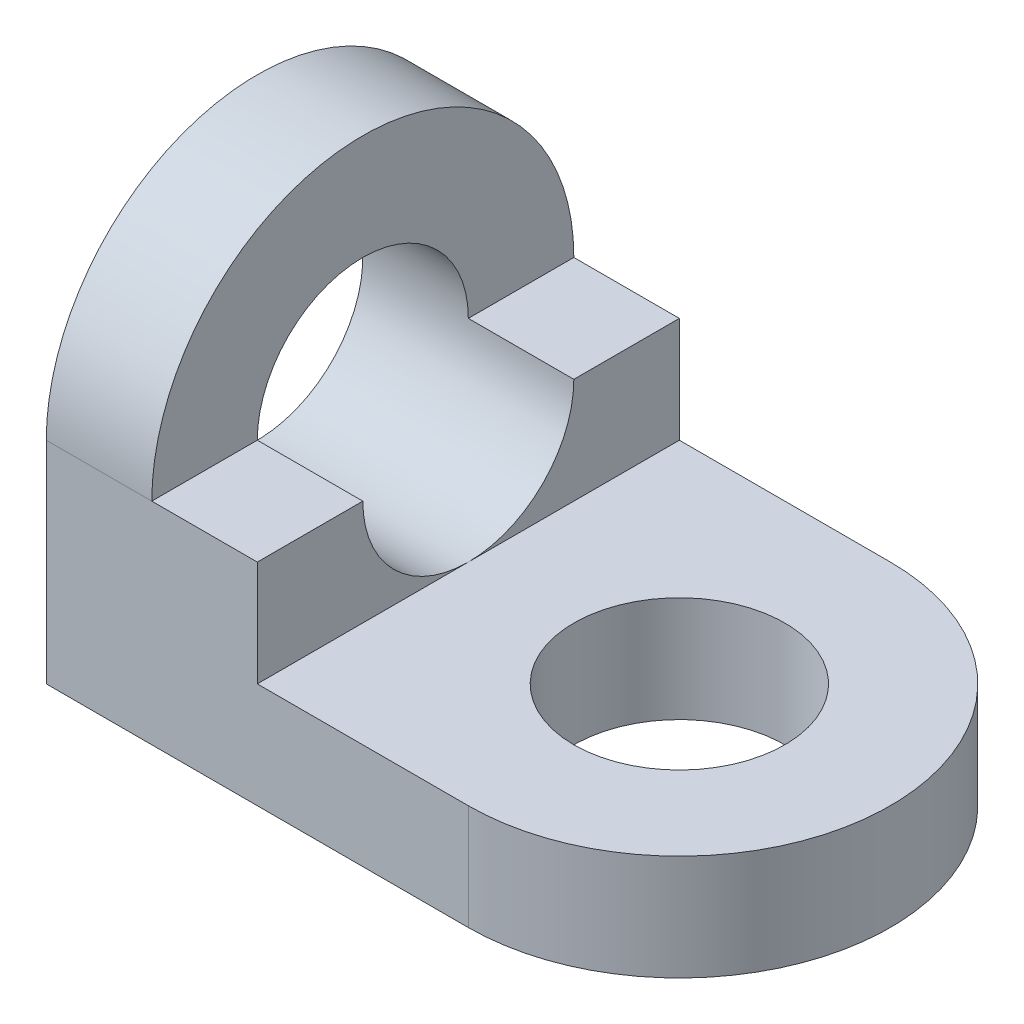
from build123d import *

# Parameters (mm, degrees)
EXTRUDE1_DEPTH = 10
EXTRUDE2_DEPTH = 10
SKETCH3_W      = 40
SKETCH3_H      = 10
EXTRUDE3_DEPTH = 10
SKETCH7_R      = 10
EXTRUDE4_DEPTH = 75.833147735
SKETCH8_R      = 10
EXTRUDE5_DEPTH = 10


with BuildPart() as part:
    # Sketch1 → Extrude1 (new body)
    with BuildSketch(Plane(origin=(0, 0, 0), x_dir=(1, 0, 0), z_dir=(0, 1, 0))):
        with BuildLine():
            Line((0, 0), (0, 20))
            Line((0, 20), (40, 20))
            ThreePointArc((40, 20), (60, 0), (40, -20))
            Line((40, -20), (0, -20))
            Line((0, -20), (0, 0))
        make_face()
    extrude(amount=EXTRUDE1_DEPTH)

    # Sketch2 → Extrude2 (add)
    with BuildSketch(Plane.ZY):
        with BuildLine():
            Line((-20, 10), (-20, 20))
            ThreePointArc((-20, 20), (0, 40), (20, 20))
            Line((20, 20), (20, 10))
            Line((20, 10), (-20, 10))
        make_face()
    extrude(amount=-EXTRUDE2_DEPTH)

    # Sketch3 → Extrude3 (add)
    with BuildSketch(Plane(origin=(10, 0, 0), x_dir=(0, 0, -1), z_dir=(1, 0, 0))):
        with Locations((0, 15)):
            Rectangle(SKETCH3_W, SKETCH3_H)
    extrude(amount=EXTRUDE3_DEPTH)

    # Sketch7 → Extrude4 (cut, through all)
    with BuildSketch(Plane.ZY):
        with Locations((0, 20)):
            Circle(SKETCH7_R)
    extrude(amount=-EXTRUDE4_DEPTH, mode=Mode.SUBTRACT)

    # Sketch8 → Extrude5 (cut)
    with BuildSketch(Plane(origin=(0, 10, 0), x_dir=(1, 0, 0), z_dir=(0, 1, 0))):
        with Locations(Location((40, 0, 0), (0, 0, 270))):
            Circle(SKETCH8_R)
    extrude(amount=-EXTRUDE5_DEPTH, mode=Mode.SUBTRACT)


solid = part.part
